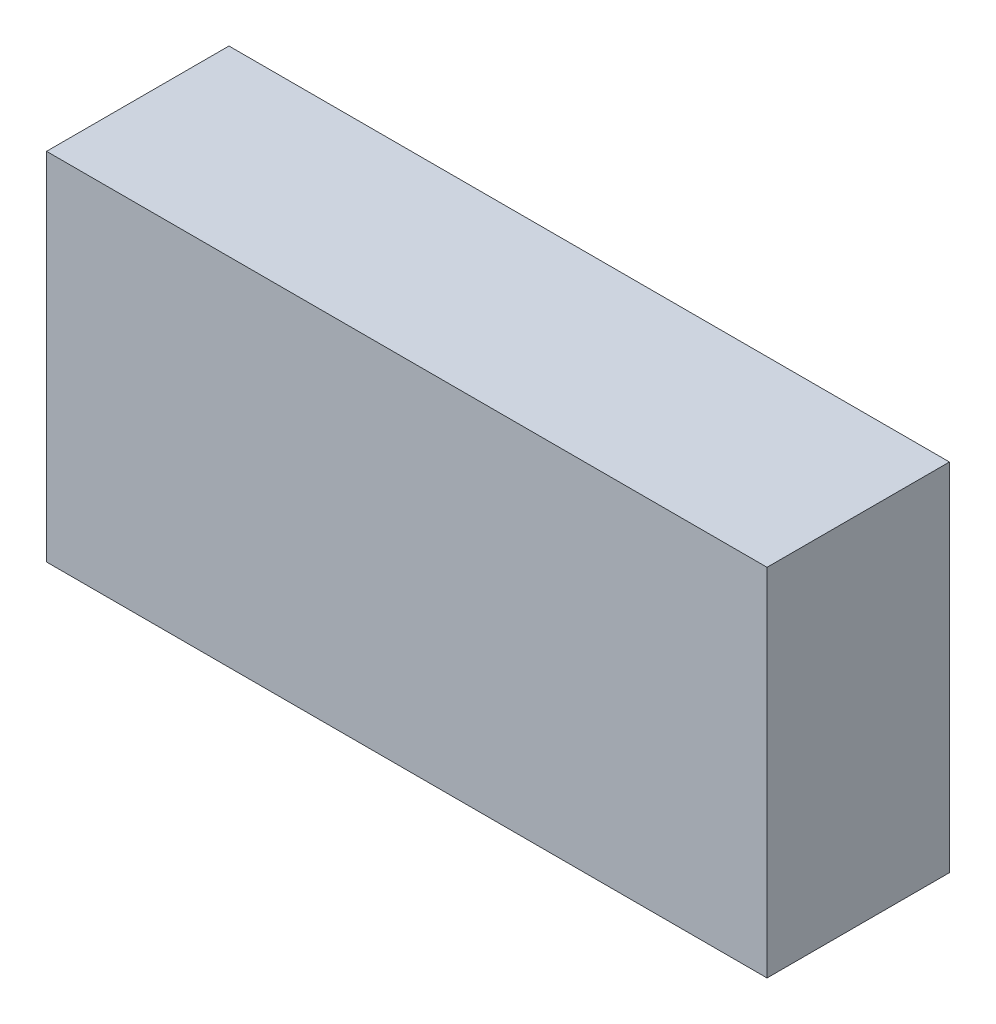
ISO-10303-21;
HEADER;
FILE_DESCRIPTION(('STEP AP214'),'2;1');
FILE_NAME('part.step','',(''),(''),'','','');
FILE_SCHEMA(('AUTOMOTIVE_DESIGN { 1 0 10303 214 1 1 1 1 }'));
ENDSEC;
DATA;
#1=APPLICATION_CONTEXT('core data for automotive mechanical design processes');
#2=APPLICATION_PROTOCOL_DEFINITION('international standard','automotive_design',2000,#1);
#3=PRODUCT_CONTEXT('',#1,'mechanical');
#4=PRODUCT('Part','Part','',(#3));
#5=PRODUCT_RELATED_PRODUCT_CATEGORY('part','',(#4));
#6=PRODUCT_DEFINITION_FORMATION('','',#4);
#7=PRODUCT_DEFINITION_CONTEXT('part definition',#1,'design');
#8=PRODUCT_DEFINITION('design','',#6,#7);
#9=PRODUCT_DEFINITION_SHAPE('','',#8);
#10=(LENGTH_UNIT() NAMED_UNIT(*) SI_UNIT(.MILLI.,.METRE.));
#11=(NAMED_UNIT(*) PLANE_ANGLE_UNIT() SI_UNIT($,.RADIAN.));
#12=(NAMED_UNIT(*) SI_UNIT($,.STERADIAN.) SOLID_ANGLE_UNIT());
#13=UNCERTAINTY_MEASURE_WITH_UNIT(LENGTH_MEASURE(1.E-05),#10,'distance_accuracy_value','');
#14=(GEOMETRIC_REPRESENTATION_CONTEXT(3) GLOBAL_UNCERTAINTY_ASSIGNED_CONTEXT((#13)) GLOBAL_UNIT_ASSIGNED_CONTEXT((#10,
#11,#12)) REPRESENTATION_CONTEXT('',''));
#15=CARTESIAN_POINT('',(0.,0.,0.));
#16=DIRECTION('',(0.,0.,1.));
#17=DIRECTION('',(1.,0.,0.));
#18=AXIS2_PLACEMENT_3D('',#15,#16,#17);
#19=CARTESIAN_POINT('',(-1.18499895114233,0.584999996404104,0.));
#20=DIRECTION('',(-8.74227765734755E-08,0.999999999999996,0.));
#21=DIRECTION('',(0.999999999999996,8.74227765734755E-08,0.));
#22=AXIS2_PLACEMENT_3D('',#19,#20,#21);
#23=PLANE('',#22);
#24=DIRECTION('',(0.,0.,1.));
#25=VECTOR('',#24,1.);
#26=CARTESIAN_POINT('',(-1.18499895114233,0.584999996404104,0.));
#27=LINE('',#26,#25);
#28=CARTESIAN_POINT('',(-1.18499895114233,0.584999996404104,0.));
#29=VERTEX_POINT('',#28);
#30=CARTESIAN_POINT('',(-1.18499895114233,0.584999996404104,0.5999988));
#31=VERTEX_POINT('',#30);
#32=EDGE_CURVE('E11',#29,#31,#27,.T.);
#33=ORIENTED_EDGE('',*,*,#32,.T.);
#34=DIRECTION('',(0.999999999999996,8.74227765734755E-08,0.));
#35=VECTOR('',#34,1.);
#36=CARTESIAN_POINT('',(-1.18499895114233,0.584999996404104,0.5999988));
#37=LINE('',#36,#35);
#38=CARTESIAN_POINT('',(1.18499884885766,0.585000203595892,0.5999988));
#39=VERTEX_POINT('',#38);
#40=EDGE_CURVE('E24',#31,#39,#37,.T.);
#41=ORIENTED_EDGE('',*,*,#40,.T.);
#42=DIRECTION('',(0.,0.,1.));
#43=VECTOR('',#42,1.);
#44=CARTESIAN_POINT('',(1.18499884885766,0.585000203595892,0.));
#45=LINE('',#44,#43);
#46=CARTESIAN_POINT('',(1.18499884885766,0.585000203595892,0.));
#47=VERTEX_POINT('',#46);
#48=EDGE_CURVE('E85',#47,#39,#45,.T.);
#49=ORIENTED_EDGE('',*,*,#48,.F.);
#50=DIRECTION('',(0.999999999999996,8.74227765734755E-08,0.));
#51=VECTOR('',#50,1.);
#52=CARTESIAN_POINT('',(-1.18499895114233,0.584999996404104,0.));
#53=LINE('',#52,#51);
#54=EDGE_CURVE('E83',#29,#47,#53,.T.);
#55=ORIENTED_EDGE('',*,*,#54,.F.);
#56=EDGE_LOOP('',(#33,#41,#49,#55));
#57=FACE_BOUND('',#56,.T.);
#58=ADVANCED_FACE('F17',(#57),#23,.T.);
#59=CARTESIAN_POINT('',(1.18499884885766,0.585000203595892,0.));
#60=DIRECTION('',(0.999999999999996,8.74227765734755E-08,0.));
#61=DIRECTION('',(8.74227765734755E-08,-0.999999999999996,0.));
#62=AXIS2_PLACEMENT_3D('',#59,#60,#61);
#63=PLANE('',#62);
#64=ORIENTED_EDGE('',*,*,#48,.T.);
#65=DIRECTION('',(8.74227765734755E-08,-0.999999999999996,0.));
#66=VECTOR('',#65,1.);
#67=CARTESIAN_POINT('',(1.18499884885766,0.585000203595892,0.5999988));
#68=LINE('',#67,#66);
#69=CARTESIAN_POINT('',(1.18499895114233,-0.584999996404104,0.5999988));
#70=VERTEX_POINT('',#69);
#71=EDGE_CURVE('E81',#39,#70,#68,.T.);
#72=ORIENTED_EDGE('',*,*,#71,.T.);
#73=DIRECTION('',(0.,0.,1.));
#74=VECTOR('',#73,1.);
#75=CARTESIAN_POINT('',(1.18499895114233,-0.584999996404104,0.));
#76=LINE('',#75,#74);
#77=CARTESIAN_POINT('',(1.18499895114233,-0.584999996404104,0.));
#78=VERTEX_POINT('',#77);
#79=EDGE_CURVE('E79',#78,#70,#76,.T.);
#80=ORIENTED_EDGE('',*,*,#79,.F.);
#81=DIRECTION('',(8.74227765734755E-08,-0.999999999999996,0.));
#82=VECTOR('',#81,1.);
#83=CARTESIAN_POINT('',(1.18499884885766,0.585000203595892,0.));
#84=LINE('',#83,#82);
#85=EDGE_CURVE('E69',#47,#78,#84,.T.);
#86=ORIENTED_EDGE('',*,*,#85,.F.);
#87=EDGE_LOOP('',(#64,#72,#80,#86));
#88=FACE_BOUND('',#87,.T.);
#89=ADVANCED_FACE('F90',(#88),#63,.T.);
#90=CARTESIAN_POINT('',(1.18499895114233,-0.584999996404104,0.));
#91=DIRECTION('',(8.74227765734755E-08,-0.999999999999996,0.));
#92=DIRECTION('',(-0.999999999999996,-8.74227765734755E-08,0.));
#93=AXIS2_PLACEMENT_3D('',#90,#91,#92);
#94=PLANE('',#93);
#95=ORIENTED_EDGE('',*,*,#79,.T.);
#96=DIRECTION('',(-0.999999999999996,-8.74227765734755E-08,0.));
#97=VECTOR('',#96,1.);
#98=CARTESIAN_POINT('',(1.18499895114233,-0.584999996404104,0.5999988));
#99=LINE('',#98,#97);
#100=CARTESIAN_POINT('',(-1.18499884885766,-0.585000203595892,0.5999988));
#101=VERTEX_POINT('',#100);
#102=EDGE_CURVE('E60',#70,#101,#99,.T.);
#103=ORIENTED_EDGE('',*,*,#102,.T.);
#104=DIRECTION('',(0.,0.,1.));
#105=VECTOR('',#104,1.);
#106=CARTESIAN_POINT('',(-1.18499884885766,-0.585000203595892,0.));
#107=LINE('',#106,#105);
#108=CARTESIAN_POINT('',(-1.18499884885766,-0.585000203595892,0.));
#109=VERTEX_POINT('',#108);
#110=EDGE_CURVE('E54',#109,#101,#107,.T.);
#111=ORIENTED_EDGE('',*,*,#110,.F.);
#112=DIRECTION('',(-0.999999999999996,-8.74227765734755E-08,0.));
#113=VECTOR('',#112,1.);
#114=CARTESIAN_POINT('',(1.18499895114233,-0.584999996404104,0.));
#115=LINE('',#114,#113);
#116=EDGE_CURVE('E58',#78,#109,#115,.T.);
#117=ORIENTED_EDGE('',*,*,#116,.F.);
#118=EDGE_LOOP('',(#95,#103,#111,#117));
#119=FACE_BOUND('',#118,.T.);
#120=ADVANCED_FACE('F57',(#119),#94,.T.);
#121=CARTESIAN_POINT('',(-1.18499884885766,-0.585000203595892,0.));
#122=DIRECTION('',(-0.999999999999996,-8.74227765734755E-08,0.));
#123=DIRECTION('',(-8.74227765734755E-08,0.999999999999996,0.));
#124=AXIS2_PLACEMENT_3D('',#121,#122,#123);
#125=PLANE('',#124);
#126=ORIENTED_EDGE('',*,*,#110,.T.);
#127=DIRECTION('',(-8.74227765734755E-08,0.999999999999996,0.));
#128=VECTOR('',#127,1.);
#129=CARTESIAN_POINT('',(-1.18499884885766,-0.585000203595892,0.5999988));
#130=LINE('',#129,#128);
#131=EDGE_CURVE('E71',#101,#31,#130,.T.);
#132=ORIENTED_EDGE('',*,*,#131,.T.);
#133=ORIENTED_EDGE('',*,*,#32,.F.);
#134=DIRECTION('',(-8.74227765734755E-08,0.999999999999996,0.));
#135=VECTOR('',#134,1.);
#136=CARTESIAN_POINT('',(-1.18499884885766,-0.585000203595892,0.));
#137=LINE('',#136,#135);
#138=EDGE_CURVE('E67',#109,#29,#137,.T.);
#139=ORIENTED_EDGE('',*,*,#138,.F.);
#140=EDGE_LOOP('',(#126,#132,#133,#139));
#141=FACE_BOUND('',#140,.T.);
#142=ADVANCED_FACE('F73',(#141),#125,.T.);
#143=CARTESIAN_POINT('',(-1.18499895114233,0.584999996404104,0.));
#144=DIRECTION('',(0.,0.,1.));
#145=DIRECTION('',(-0.999999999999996,-8.74227765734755E-08,0.));
#146=AXIS2_PLACEMENT_3D('',#143,#144,#145);
#147=PLANE('',#146);
#148=ORIENTED_EDGE('',*,*,#54,.T.);
#149=ORIENTED_EDGE('',*,*,#85,.T.);
#150=ORIENTED_EDGE('',*,*,#116,.T.);
#151=ORIENTED_EDGE('',*,*,#138,.T.);
#152=EDGE_LOOP('',(#148,#149,#150,#151));
#153=FACE_BOUND('',#152,.T.);
#154=ADVANCED_FACE('F66',(#153),#147,.F.);
#155=CARTESIAN_POINT('',(-1.18499895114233,0.584999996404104,0.5999988));
#156=DIRECTION('',(0.,0.,1.));
#157=DIRECTION('',(-0.999999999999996,-8.74227765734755E-08,0.));
#158=AXIS2_PLACEMENT_3D('',#155,#156,#157);
#159=PLANE('',#158);
#160=ORIENTED_EDGE('',*,*,#131,.F.);
#161=ORIENTED_EDGE('',*,*,#102,.F.);
#162=ORIENTED_EDGE('',*,*,#71,.F.);
#163=ORIENTED_EDGE('',*,*,#40,.F.);
#164=EDGE_LOOP('',(#160,#161,#162,#163));
#165=FACE_BOUND('',#164,.T.);
#166=ADVANCED_FACE('F91',(#165),#159,.T.);
#167=CLOSED_SHELL('',(#58,#89,#120,#142,#154,#166));
#168=MANIFOLD_SOLID_BREP('B1',#167);
#169=ADVANCED_BREP_SHAPE_REPRESENTATION('',(#18,#168),#14);
#170=SHAPE_DEFINITION_REPRESENTATION(#9,#169);
ENDSEC;
END-ISO-10303-21;
